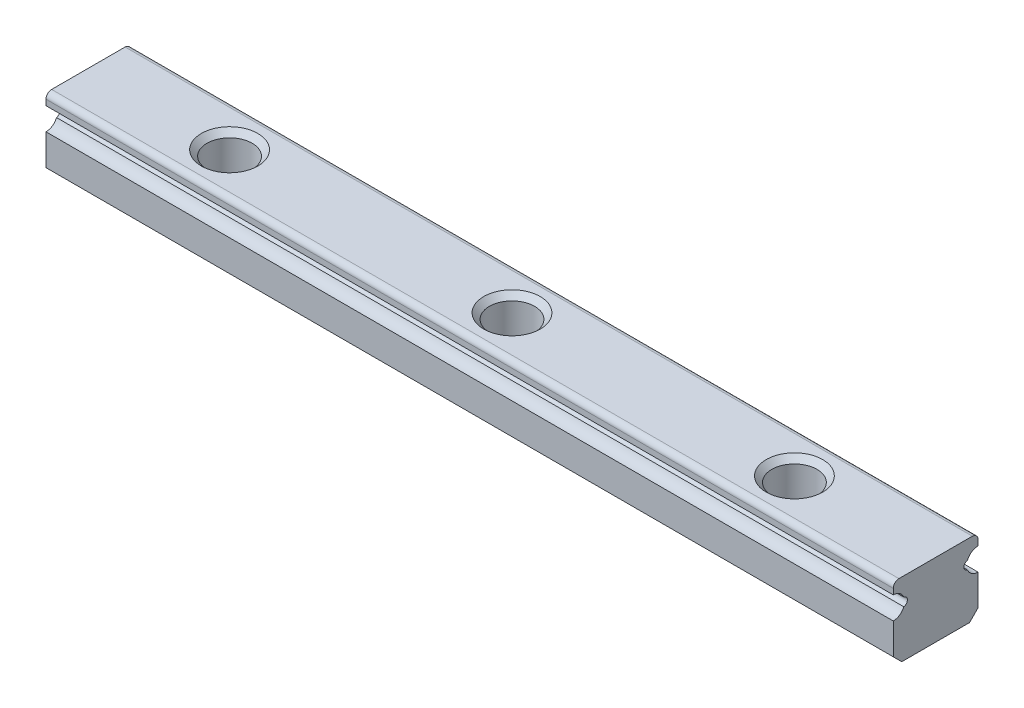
ISO-10303-21;
HEADER;
FILE_DESCRIPTION(('STEP AP214'),'2;1');
FILE_NAME('part.step','',(''),(''),'','','');
FILE_SCHEMA(('AUTOMOTIVE_DESIGN { 1 0 10303 214 1 1 1 1 }'));
ENDSEC;
DATA;
#1=APPLICATION_CONTEXT('core data for automotive mechanical design processes');
#2=APPLICATION_PROTOCOL_DEFINITION('international standard','automotive_design',2000,#1);
#3=PRODUCT_CONTEXT('',#1,'mechanical');
#4=PRODUCT('Part','Part','',(#3));
#5=PRODUCT_RELATED_PRODUCT_CATEGORY('part','',(#4));
#6=PRODUCT_DEFINITION_FORMATION('','',#4);
#7=PRODUCT_DEFINITION_CONTEXT('part definition',#1,'design');
#8=PRODUCT_DEFINITION('design','',#6,#7);
#9=PRODUCT_DEFINITION_SHAPE('','',#8);
#10=(LENGTH_UNIT() NAMED_UNIT(*) SI_UNIT(.MILLI.,.METRE.));
#11=(NAMED_UNIT(*) PLANE_ANGLE_UNIT() SI_UNIT($,.RADIAN.));
#12=(NAMED_UNIT(*) SI_UNIT($,.STERADIAN.) SOLID_ANGLE_UNIT());
#13=UNCERTAINTY_MEASURE_WITH_UNIT(LENGTH_MEASURE(1.E-05),#10,'distance_accuracy_value','');
#14=(GEOMETRIC_REPRESENTATION_CONTEXT(3) GLOBAL_UNCERTAINTY_ASSIGNED_CONTEXT((#13)) GLOBAL_UNIT_ASSIGNED_CONTEXT((#10,
#11,#12)) REPRESENTATION_CONTEXT('',''));
#15=CARTESIAN_POINT('',(0.,0.,0.));
#16=DIRECTION('',(0.,0.,1.));
#17=DIRECTION('',(1.,0.,0.));
#18=AXIS2_PLACEMENT_3D('',#15,#16,#17);
#19=CARTESIAN_POINT('',(-30.,0.3,1.5));
#20=DIRECTION('',(0.,0.,1.));
#21=DIRECTION('',(0.,-1.,0.));
#22=AXIS2_PLACEMENT_3D('',#19,#20,#21);
#23=PLANE('',#22);
#24=DIRECTION('',(1.,0.,0.));
#25=VECTOR('',#24,1.);
#26=CARTESIAN_POINT('',(-30.,1.4,1.5));
#27=LINE('',#26,#25);
#28=CARTESIAN_POINT('',(-30.,1.4,1.5));
#29=VERTEX_POINT('',#28);
#30=CARTESIAN_POINT('',(0.,1.4,1.5));
#31=VERTEX_POINT('',#30);
#32=EDGE_CURVE('E179',#29,#31,#27,.T.);
#33=ORIENTED_EDGE('',*,*,#32,.F.);
#34=DIRECTION('',(0.,-1.,0.));
#35=VECTOR('',#34,1.);
#36=CARTESIAN_POINT('',(-30.,0.3,1.5));
#37=LINE('',#36,#35);
#38=CARTESIAN_POINT('',(-30.,0.3,1.5));
#39=VERTEX_POINT('',#38);
#40=EDGE_CURVE('E167',#29,#39,#37,.T.);
#41=ORIENTED_EDGE('',*,*,#40,.T.);
#42=DIRECTION('',(1.,0.,0.));
#43=VECTOR('',#42,1.);
#44=CARTESIAN_POINT('',(-30.,0.3,1.5));
#45=LINE('',#44,#43);
#46=CARTESIAN_POINT('',(0.,0.3,1.5));
#47=VERTEX_POINT('',#46);
#48=EDGE_CURVE('E244',#39,#47,#45,.T.);
#49=ORIENTED_EDGE('',*,*,#48,.T.);
#50=DIRECTION('',(0.,-1.,0.));
#51=VECTOR('',#50,1.);
#52=CARTESIAN_POINT('',(0.,0.3,1.5));
#53=LINE('',#52,#51);
#54=EDGE_CURVE('E226',#31,#47,#53,.T.);
#55=ORIENTED_EDGE('',*,*,#54,.F.);
#56=EDGE_LOOP('',(#33,#41,#49,#55));
#57=FACE_BOUND('',#56,.T.);
#58=ADVANCED_FACE('F32',(#57),#23,.T.);
#59=CARTESIAN_POINT('',(-30.,0.3,-1.5));
#60=DIRECTION('',(0.,0.,-1.));
#61=DIRECTION('',(0.,1.,0.));
#62=AXIS2_PLACEMENT_3D('',#59,#60,#61);
#63=PLANE('',#62);
#64=DIRECTION('',(0.,1.,0.));
#65=VECTOR('',#64,1.);
#66=CARTESIAN_POINT('',(-30.,0.3,-1.5));
#67=LINE('',#66,#65);
#68=CARTESIAN_POINT('',(-30.,2.2,-1.5));
#69=VERTEX_POINT('',#68);
#70=CARTESIAN_POINT('',(-30.,2.4,-1.5));
#71=VERTEX_POINT('',#70);
#72=EDGE_CURVE('E238',#69,#71,#67,.T.);
#73=ORIENTED_EDGE('',*,*,#72,.T.);
#74=DIRECTION('',(1.,0.,0.));
#75=VECTOR('',#74,1.);
#76=CARTESIAN_POINT('',(-30.,2.4,-1.5));
#77=LINE('',#76,#75);
#78=CARTESIAN_POINT('',(0.,2.4,-1.5));
#79=VERTEX_POINT('',#78);
#80=EDGE_CURVE('E286',#71,#79,#77,.T.);
#81=ORIENTED_EDGE('',*,*,#80,.T.);
#82=DIRECTION('',(0.,1.,0.));
#83=VECTOR('',#82,1.);
#84=CARTESIAN_POINT('',(0.,0.3,-1.5));
#85=LINE('',#84,#83);
#86=CARTESIAN_POINT('',(0.,2.2,-1.5));
#87=VERTEX_POINT('',#86);
#88=EDGE_CURVE('E256',#87,#79,#85,.T.);
#89=ORIENTED_EDGE('',*,*,#88,.F.);
#90=DIRECTION('',(1.,0.,0.));
#91=VECTOR('',#90,1.);
#92=CARTESIAN_POINT('',(-30.,2.2,-1.5));
#93=LINE('',#92,#91);
#94=EDGE_CURVE('E200',#69,#87,#93,.T.);
#95=ORIENTED_EDGE('',*,*,#94,.F.);
#96=EDGE_LOOP('',(#73,#81,#89,#95));
#97=FACE_BOUND('',#96,.T.);
#98=ADVANCED_FACE('F307',(#97),#63,.T.);
#99=CARTESIAN_POINT('',(-30.,0.,-1.2));
#100=DIRECTION('',(0.,-1.,0.));
#101=DIRECTION('',(0.,0.,-1.));
#102=AXIS2_PLACEMENT_3D('',#99,#100,#101);
#103=PLANE('',#102);
#104=CARTESIAN_POINT('',(-15.,0.,0.));
#105=DIRECTION('',(0.,1.,0.));
#106=DIRECTION('',(0.,0.,1.));
#107=AXIS2_PLACEMENT_3D('',#104,#105,#106);
#108=CIRCLE('',#107,1.);
#109=CARTESIAN_POINT('',(-15.,0.,0.999999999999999));
#110=VERTEX_POINT('',#109);
#111=EDGE_CURVE('E202',#110,#110,#108,.T.);
#112=ORIENTED_EDGE('',*,*,#111,.T.);
#113=EDGE_LOOP('',(#112));
#114=FACE_BOUND('',#113,.T.);
#115=DIRECTION('',(0.,0.,-1.));
#116=VECTOR('',#115,1.);
#117=CARTESIAN_POINT('',(0.,0.,-1.2));
#118=LINE('',#117,#116);
#119=CARTESIAN_POINT('',(0.,0.,1.2));
#120=VERTEX_POINT('',#119);
#121=CARTESIAN_POINT('',(0.,0.,-1.2));
#122=VERTEX_POINT('',#121);
#123=EDGE_CURVE('E250',#120,#122,#118,.T.);
#124=ORIENTED_EDGE('',*,*,#123,.F.);
#125=DIRECTION('',(1.,0.,0.));
#126=VECTOR('',#125,1.);
#127=CARTESIAN_POINT('',(-30.,0.,1.2));
#128=LINE('',#127,#126);
#129=CARTESIAN_POINT('',(-30.,0.,1.2));
#130=VERTEX_POINT('',#129);
#131=EDGE_CURVE('E268',#130,#120,#128,.T.);
#132=ORIENTED_EDGE('',*,*,#131,.F.);
#133=DIRECTION('',(0.,0.,-1.));
#134=VECTOR('',#133,1.);
#135=CARTESIAN_POINT('',(-30.,0.,-1.2));
#136=LINE('',#135,#134);
#137=CARTESIAN_POINT('',(-30.,0.,-1.2));
#138=VERTEX_POINT('',#137);
#139=EDGE_CURVE('E232',#130,#138,#136,.T.);
#140=ORIENTED_EDGE('',*,*,#139,.T.);
#141=DIRECTION('',(1.,0.,0.));
#142=VECTOR('',#141,1.);
#143=CARTESIAN_POINT('',(-30.,0.,-1.2));
#144=LINE('',#143,#142);
#145=EDGE_CURVE('E266',#138,#122,#144,.T.);
#146=ORIENTED_EDGE('',*,*,#145,.T.);
#147=EDGE_LOOP('',(#124,#132,#140,#146));
#148=FACE_BOUND('',#147,.T.);
#149=CARTESIAN_POINT('',(-5.,0.,0.));
#150=DIRECTION('',(0.,1.,0.));
#151=DIRECTION('',(0.,0.,1.));
#152=AXIS2_PLACEMENT_3D('',#149,#150,#151);
#153=CIRCLE('',#152,1.);
#154=CARTESIAN_POINT('',(-5.,0.,0.999999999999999));
#155=VERTEX_POINT('',#154);
#156=EDGE_CURVE('E214',#155,#155,#153,.T.);
#157=ORIENTED_EDGE('',*,*,#156,.T.);
#158=EDGE_LOOP('',(#157));
#159=FACE_BOUND('',#158,.T.);
#160=CARTESIAN_POINT('',(-25.,0.,0.));
#161=DIRECTION('',(0.,1.,0.));
#162=DIRECTION('',(0.,0.,1.));
#163=AXIS2_PLACEMENT_3D('',#160,#161,#162);
#164=CIRCLE('',#163,1.);
#165=CARTESIAN_POINT('',(-25.,0.,0.999999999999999));
#166=VERTEX_POINT('',#165);
#167=EDGE_CURVE('E265',#166,#166,#164,.T.);
#168=ORIENTED_EDGE('',*,*,#167,.T.);
#169=EDGE_LOOP('',(#168));
#170=FACE_BOUND('',#169,.T.);
#171=ADVANCED_FACE('F334',(#114,#148,#159,#170),#103,.T.);
#172=CARTESIAN_POINT('',(0.,2.4,1.5));
#173=VERTEX_POINT('',#172);
#174=CARTESIAN_POINT('',(0.,2.2,1.5));
#175=VERTEX_POINT('',#174);
#176=EDGE_CURVE('E245',#173,#175,#53,.T.);
#177=ORIENTED_EDGE('',*,*,#176,.F.);
#178=DIRECTION('',(1.,0.,0.));
#179=VECTOR('',#178,1.);
#180=CARTESIAN_POINT('',(-30.,2.4,1.5));
#181=LINE('',#180,#179);
#182=CARTESIAN_POINT('',(-30.,2.4,1.5));
#183=VERTEX_POINT('',#182);
#184=EDGE_CURVE('E11',#173,#183,#181,.F.);
#185=ORIENTED_EDGE('',*,*,#184,.T.);
#186=CARTESIAN_POINT('',(-30.,2.2,1.5));
#187=VERTEX_POINT('',#186);
#188=EDGE_CURVE('E227',#183,#187,#37,.T.);
#189=ORIENTED_EDGE('',*,*,#188,.T.);
#190=DIRECTION('',(1.,0.,0.));
#191=VECTOR('',#190,1.);
#192=CARTESIAN_POINT('',(-30.,2.2,1.5));
#193=LINE('',#192,#191);
#194=EDGE_CURVE('E175',#175,#187,#193,.F.);
#195=ORIENTED_EDGE('',*,*,#194,.F.);
#196=EDGE_LOOP('',(#177,#185,#189,#195));
#197=FACE_BOUND('',#196,.T.);
#198=ADVANCED_FACE('F322',(#197),#23,.T.);
#199=CARTESIAN_POINT('',(-30.,2.6,-1.5));
#200=DIRECTION('',(0.,1.,0.));
#201=DIRECTION('',(0.,0.,1.));
#202=AXIS2_PLACEMENT_3D('',#199,#200,#201);
#203=PLANE('',#202);
#204=CARTESIAN_POINT('',(-15.,2.6,0.));
#205=DIRECTION('',(0.,1.,0.));
#206=DIRECTION('',(0.,0.,1.));
#207=AXIS2_PLACEMENT_3D('',#204,#205,#206);
#208=CIRCLE('',#207,1.);
#209=CARTESIAN_POINT('',(-15.,2.6,1.));
#210=VERTEX_POINT('',#209);
#211=EDGE_CURVE('E205',#210,#210,#208,.T.);
#212=ORIENTED_EDGE('',*,*,#211,.F.);
#213=EDGE_LOOP('',(#212));
#214=FACE_BOUND('',#213,.T.);
#215=CARTESIAN_POINT('',(-5.,2.6,0.));
#216=DIRECTION('',(0.,1.,0.));
#217=DIRECTION('',(0.,0.,1.));
#218=AXIS2_PLACEMENT_3D('',#215,#216,#217);
#219=CIRCLE('',#218,1.);
#220=CARTESIAN_POINT('',(-5.,2.6,1.));
#221=VERTEX_POINT('',#220);
#222=EDGE_CURVE('E223',#221,#221,#219,.T.);
#223=ORIENTED_EDGE('',*,*,#222,.F.);
#224=EDGE_LOOP('',(#223));
#225=FACE_BOUND('',#224,.T.);
#226=DIRECTION('',(0.,0.,1.));
#227=VECTOR('',#226,1.);
#228=CARTESIAN_POINT('',(0.,2.6,-1.5));
#229=LINE('',#228,#227);
#230=CARTESIAN_POINT('',(0.,2.6,-1.3));
#231=VERTEX_POINT('',#230);
#232=CARTESIAN_POINT('',(0.,2.6,1.3));
#233=VERTEX_POINT('',#232);
#234=EDGE_CURVE('E260',#231,#233,#229,.T.);
#235=ORIENTED_EDGE('',*,*,#234,.F.);
#236=DIRECTION('',(1.,0.,0.));
#237=VECTOR('',#236,1.);
#238=CARTESIAN_POINT('',(-30.,2.6,-1.3));
#239=LINE('',#238,#237);
#240=CARTESIAN_POINT('',(-30.,2.6,-1.3));
#241=VERTEX_POINT('',#240);
#242=EDGE_CURVE('E296',#231,#241,#239,.F.);
#243=ORIENTED_EDGE('',*,*,#242,.T.);
#244=DIRECTION('',(0.,0.,1.));
#245=VECTOR('',#244,1.);
#246=CARTESIAN_POINT('',(-30.,2.6,-1.5));
#247=LINE('',#246,#245);
#248=CARTESIAN_POINT('',(-30.,2.6,1.3));
#249=VERTEX_POINT('',#248);
#250=EDGE_CURVE('E242',#241,#249,#247,.T.);
#251=ORIENTED_EDGE('',*,*,#250,.T.);
#252=DIRECTION('',(1.,0.,0.));
#253=VECTOR('',#252,1.);
#254=CARTESIAN_POINT('',(-30.,2.6,1.3));
#255=LINE('',#254,#253);
#256=EDGE_CURVE('E293',#249,#233,#255,.T.);
#257=ORIENTED_EDGE('',*,*,#256,.T.);
#258=EDGE_LOOP('',(#235,#243,#251,#257));
#259=FACE_BOUND('',#258,.T.);
#260=CARTESIAN_POINT('',(-25.,2.6,0.));
#261=DIRECTION('',(0.,1.,0.));
#262=DIRECTION('',(0.,0.,1.));
#263=AXIS2_PLACEMENT_3D('',#260,#261,#262);
#264=CIRCLE('',#263,1.);
#265=CARTESIAN_POINT('',(-25.,2.6,1.));
#266=VERTEX_POINT('',#265);
#267=EDGE_CURVE('E274',#266,#266,#264,.T.);
#268=ORIENTED_EDGE('',*,*,#267,.F.);
#269=EDGE_LOOP('',(#268));
#270=FACE_BOUND('',#269,.T.);
#271=ADVANCED_FACE('F316',(#214,#225,#259,#270),#203,.T.);
#272=DIRECTION('',(1.,0.,0.));
#273=VECTOR('',#272,1.);
#274=CARTESIAN_POINT('',(-30.,1.4,-1.5));
#275=LINE('',#274,#273);
#276=CARTESIAN_POINT('',(0.,1.4,-1.5));
#277=VERTEX_POINT('',#276);
#278=CARTESIAN_POINT('',(-30.,1.4,-1.5));
#279=VERTEX_POINT('',#278);
#280=EDGE_CURVE('E197',#277,#279,#275,.F.);
#281=ORIENTED_EDGE('',*,*,#280,.F.);
#282=CARTESIAN_POINT('',(0.,0.3,-1.5));
#283=VERTEX_POINT('',#282);
#284=EDGE_CURVE('E257',#283,#277,#85,.T.);
#285=ORIENTED_EDGE('',*,*,#284,.F.);
#286=DIRECTION('',(1.,0.,0.));
#287=VECTOR('',#286,1.);
#288=CARTESIAN_POINT('',(-30.,0.3,-1.5));
#289=LINE('',#288,#287);
#290=CARTESIAN_POINT('',(-30.,0.3,-1.5));
#291=VERTEX_POINT('',#290);
#292=EDGE_CURVE('E263',#291,#283,#289,.T.);
#293=ORIENTED_EDGE('',*,*,#292,.F.);
#294=EDGE_CURVE('E239',#291,#279,#67,.T.);
#295=ORIENTED_EDGE('',*,*,#294,.T.);
#296=EDGE_LOOP('',(#281,#285,#293,#295));
#297=FACE_BOUND('',#296,.T.);
#298=ADVANCED_FACE('F344',(#297),#63,.T.);
#299=CARTESIAN_POINT('',(-30.,0.,-1.2));
#300=DIRECTION('',(0.,-0.707106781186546,-0.707106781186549));
#301=DIRECTION('',(0.,0.707106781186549,-0.707106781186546));
#302=AXIS2_PLACEMENT_3D('',#299,#300,#301);
#303=PLANE('',#302);
#304=DIRECTION('',(0.,0.707106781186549,-0.707106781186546));
#305=VECTOR('',#304,1.);
#306=CARTESIAN_POINT('',(0.,0.,-1.2));
#307=LINE('',#306,#305);
#308=EDGE_CURVE('E253',#122,#283,#307,.T.);
#309=ORIENTED_EDGE('',*,*,#308,.F.);
#310=ORIENTED_EDGE('',*,*,#145,.F.);
#311=DIRECTION('',(0.,0.707106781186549,-0.707106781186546));
#312=VECTOR('',#311,1.);
#313=CARTESIAN_POINT('',(-30.,0.,-1.2));
#314=LINE('',#313,#312);
#315=EDGE_CURVE('E235',#138,#291,#314,.T.);
#316=ORIENTED_EDGE('',*,*,#315,.T.);
#317=ORIENTED_EDGE('',*,*,#292,.T.);
#318=EDGE_LOOP('',(#309,#310,#316,#317));
#319=FACE_BOUND('',#318,.T.);
#320=ADVANCED_FACE('F339',(#319),#303,.T.);
#321=CARTESIAN_POINT('',(-30.,0.,1.2));
#322=DIRECTION('',(0.,-0.707106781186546,0.707106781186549));
#323=DIRECTION('',(0.,-0.707106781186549,-0.707106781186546));
#324=AXIS2_PLACEMENT_3D('',#321,#322,#323);
#325=PLANE('',#324);
#326=DIRECTION('',(0.,-0.707106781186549,-0.707106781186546));
#327=VECTOR('',#326,1.);
#328=CARTESIAN_POINT('',(0.,0.,1.2));
#329=LINE('',#328,#327);
#330=EDGE_CURVE('E247',#47,#120,#329,.T.);
#331=ORIENTED_EDGE('',*,*,#330,.F.);
#332=ORIENTED_EDGE('',*,*,#48,.F.);
#333=DIRECTION('',(0.,-0.707106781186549,-0.707106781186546));
#334=VECTOR('',#333,1.);
#335=CARTESIAN_POINT('',(-30.,0.,1.2));
#336=LINE('',#335,#334);
#337=EDGE_CURVE('E229',#39,#130,#336,.T.);
#338=ORIENTED_EDGE('',*,*,#337,.T.);
#339=ORIENTED_EDGE('',*,*,#131,.T.);
#340=EDGE_LOOP('',(#331,#332,#338,#339));
#341=FACE_BOUND('',#340,.T.);
#342=ADVANCED_FACE('F330',(#341),#325,.T.);
#343=CARTESIAN_POINT('',(-30.,0.,1.5));
#344=DIRECTION('',(1.,0.,0.));
#345=DIRECTION('',(0.,0.,-1.));
#346=AXIS2_PLACEMENT_3D('',#343,#344,#345);
#347=PLANE('',#346);
#348=ORIENTED_EDGE('',*,*,#250,.F.);
#349=CARTESIAN_POINT('',(-30.,2.4,-1.3));
#350=DIRECTION('',(1.,0.,0.));
#351=DIRECTION('',(0.,0.,-1.));
#352=AXIS2_PLACEMENT_3D('',#349,#350,#351);
#353=CIRCLE('',#352,0.2);
#354=EDGE_CURVE('E40',#241,#71,#353,.F.);
#355=ORIENTED_EDGE('',*,*,#354,.T.);
#356=ORIENTED_EDGE('',*,*,#72,.F.);
#357=CARTESIAN_POINT('',(-30.,1.8,-1.5));
#358=DIRECTION('',(1.,0.,0.));
#359=DIRECTION('',(0.,0.,-1.));
#360=AXIS2_PLACEMENT_3D('',#357,#358,#359);
#361=CIRCLE('',#360,0.4);
#362=CARTESIAN_POINT('',(-30.,1.94846149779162,-1.12857142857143));
#363=VERTEX_POINT('',#362);
#364=EDGE_CURVE('E185',#69,#363,#361,.T.);
#365=ORIENTED_EDGE('',*,*,#364,.T.);
#366=CARTESIAN_POINT('',(-30.,1.8,-1.15));
#367=DIRECTION('',(1.,0.,0.));
#368=DIRECTION('',(0.,0.,-1.));
#369=AXIS2_PLACEMENT_3D('',#366,#367,#368);
#370=CIRCLE('',#369,0.150000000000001);
#371=CARTESIAN_POINT('',(-30.,1.65153850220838,-1.12857142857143));
#372=VERTEX_POINT('',#371);
#373=EDGE_CURVE('E182',#363,#372,#370,.T.);
#374=ORIENTED_EDGE('',*,*,#373,.T.);
#375=EDGE_CURVE('E187',#372,#279,#361,.T.);
#376=ORIENTED_EDGE('',*,*,#375,.T.);
#377=ORIENTED_EDGE('',*,*,#294,.F.);
#378=ORIENTED_EDGE('',*,*,#315,.F.);
#379=ORIENTED_EDGE('',*,*,#139,.F.);
#380=ORIENTED_EDGE('',*,*,#337,.F.);
#381=ORIENTED_EDGE('',*,*,#40,.F.);
#382=CARTESIAN_POINT('',(-30.,1.8,1.5));
#383=DIRECTION('',(1.,0.,0.));
#384=DIRECTION('',(0.,0.,1.));
#385=AXIS2_PLACEMENT_3D('',#382,#383,#384);
#386=CIRCLE('',#385,0.4);
#387=CARTESIAN_POINT('',(-30.,1.65153850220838,1.12857142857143));
#388=VERTEX_POINT('',#387);
#389=EDGE_CURVE('E148',#29,#388,#386,.T.);
#390=ORIENTED_EDGE('',*,*,#389,.T.);
#391=CARTESIAN_POINT('',(-30.,1.8,1.15));
#392=DIRECTION('',(1.,0.,0.));
#393=DIRECTION('',(0.,0.,1.));
#394=AXIS2_PLACEMENT_3D('',#391,#392,#393);
#395=CIRCLE('',#394,0.150000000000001);
#396=CARTESIAN_POINT('',(-30.,1.94846149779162,1.12857142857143));
#397=VERTEX_POINT('',#396);
#398=EDGE_CURVE('E156',#388,#397,#395,.T.);
#399=ORIENTED_EDGE('',*,*,#398,.T.);
#400=EDGE_CURVE('E162',#397,#187,#386,.T.);
#401=ORIENTED_EDGE('',*,*,#400,.T.);
#402=ORIENTED_EDGE('',*,*,#188,.F.);
#403=CARTESIAN_POINT('',(-30.,2.4,1.3));
#404=DIRECTION('',(1.,0.,0.));
#405=DIRECTION('',(0.,0.,-1.));
#406=AXIS2_PLACEMENT_3D('',#403,#404,#405);
#407=CIRCLE('',#406,0.2);
#408=EDGE_CURVE('E52',#183,#249,#407,.F.);
#409=ORIENTED_EDGE('',*,*,#408,.T.);
#410=EDGE_LOOP('',(#348,#355,#356,#365,#374,#376,#377,#378,#379,#380,#381,#390,#399,#401,#402,#409));
#411=FACE_BOUND('',#410,.T.);
#412=ADVANCED_FACE('F165',(#411),#347,.F.);
#413=CARTESIAN_POINT('',(0.,0.,1.5));
#414=DIRECTION('',(1.,0.,0.));
#415=DIRECTION('',(0.,0.,-1.));
#416=AXIS2_PLACEMENT_3D('',#413,#414,#415);
#417=PLANE('',#416);
#418=ORIENTED_EDGE('',*,*,#88,.T.);
#419=CARTESIAN_POINT('',(0.,2.4,-1.3));
#420=DIRECTION('',(1.,0.,0.));
#421=DIRECTION('',(0.,0.,-1.));
#422=AXIS2_PLACEMENT_3D('',#419,#420,#421);
#423=CIRCLE('',#422,0.2);
#424=EDGE_CURVE('E291',#79,#231,#423,.T.);
#425=ORIENTED_EDGE('',*,*,#424,.T.);
#426=ORIENTED_EDGE('',*,*,#234,.T.);
#427=CARTESIAN_POINT('',(0.,2.4,1.3));
#428=DIRECTION('',(1.,0.,0.));
#429=DIRECTION('',(0.,0.,-1.));
#430=AXIS2_PLACEMENT_3D('',#427,#428,#429);
#431=CIRCLE('',#430,0.2);
#432=EDGE_CURVE('E289',#233,#173,#431,.T.);
#433=ORIENTED_EDGE('',*,*,#432,.T.);
#434=ORIENTED_EDGE('',*,*,#176,.T.);
#435=CARTESIAN_POINT('',(0.,1.8,1.5));
#436=DIRECTION('',(1.,0.,0.));
#437=DIRECTION('',(0.,0.,1.));
#438=AXIS2_PLACEMENT_3D('',#435,#436,#437);
#439=CIRCLE('',#438,0.4);
#440=CARTESIAN_POINT('',(0.,1.94846149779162,1.12857142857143));
#441=VERTEX_POINT('',#440);
#442=EDGE_CURVE('E170',#441,#175,#439,.T.);
#443=ORIENTED_EDGE('',*,*,#442,.F.);
#444=CARTESIAN_POINT('',(0.,1.8,1.15));
#445=DIRECTION('',(1.,0.,0.));
#446=DIRECTION('',(0.,0.,1.));
#447=AXIS2_PLACEMENT_3D('',#444,#445,#446);
#448=CIRCLE('',#447,0.150000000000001);
#449=CARTESIAN_POINT('',(0.,1.65153850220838,1.12857142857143));
#450=VERTEX_POINT('',#449);
#451=EDGE_CURVE('E168',#450,#441,#448,.T.);
#452=ORIENTED_EDGE('',*,*,#451,.F.);
#453=CARTESIAN_POINT('',(0.,1.8,1.5));
#454=DIRECTION('',(1.,0.,0.));
#455=DIRECTION('',(0.,0.,-1.));
#456=AXIS2_PLACEMENT_3D('',#453,#454,#455);
#457=CIRCLE('',#456,0.4);
#458=EDGE_CURVE('E151',#31,#450,#457,.T.);
#459=ORIENTED_EDGE('',*,*,#458,.F.);
#460=ORIENTED_EDGE('',*,*,#54,.T.);
#461=ORIENTED_EDGE('',*,*,#330,.T.);
#462=ORIENTED_EDGE('',*,*,#123,.T.);
#463=ORIENTED_EDGE('',*,*,#308,.T.);
#464=ORIENTED_EDGE('',*,*,#284,.T.);
#465=CARTESIAN_POINT('',(0.,1.8,-1.5));
#466=DIRECTION('',(1.,0.,0.));
#467=DIRECTION('',(0.,0.,-1.));
#468=AXIS2_PLACEMENT_3D('',#465,#466,#467);
#469=CIRCLE('',#468,0.4);
#470=CARTESIAN_POINT('',(0.,1.65153850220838,-1.12857142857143));
#471=VERTEX_POINT('',#470);
#472=EDGE_CURVE('E186',#471,#277,#469,.T.);
#473=ORIENTED_EDGE('',*,*,#472,.F.);
#474=CARTESIAN_POINT('',(0.,1.8,-1.15));
#475=DIRECTION('',(1.,0.,0.));
#476=DIRECTION('',(0.,0.,-1.));
#477=AXIS2_PLACEMENT_3D('',#474,#475,#476);
#478=CIRCLE('',#477,0.150000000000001);
#479=CARTESIAN_POINT('',(0.,1.94846149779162,-1.12857142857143));
#480=VERTEX_POINT('',#479);
#481=EDGE_CURVE('E181',#480,#471,#478,.T.);
#482=ORIENTED_EDGE('',*,*,#481,.F.);
#483=CARTESIAN_POINT('',(0.,1.8,-1.5));
#484=DIRECTION('',(1.,0.,0.));
#485=DIRECTION('',(0.,0.,-1.));
#486=AXIS2_PLACEMENT_3D('',#483,#484,#485);
#487=CIRCLE('',#486,0.4);
#488=EDGE_CURVE('E283',#87,#480,#487,.T.);
#489=ORIENTED_EDGE('',*,*,#488,.F.);
#490=EDGE_LOOP('',(#418,#425,#426,#433,#434,#443,#452,#459,#460,#461,#462,#463,#464,#473,#482,#489));
#491=FACE_BOUND('',#490,.T.);
#492=ADVANCED_FACE('F313',(#491),#417,.T.);
#493=CARTESIAN_POINT('',(-5.,2.6,0.));
#494=DIRECTION('',(0.,1.,0.));
#495=DIRECTION('',(0.,0.,1.));
#496=AXIS2_PLACEMENT_3D('',#493,#494,#495);
#497=CONICAL_SURFACE('',#496,1.,0.785398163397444);
#498=CARTESIAN_POINT('',(-5.,2.4,0.));
#499=DIRECTION('',(0.,1.,0.));
#500=DIRECTION('',(0.,0.,1.));
#501=AXIS2_PLACEMENT_3D('',#498,#499,#500);
#502=CIRCLE('',#501,0.8);
#503=CARTESIAN_POINT('',(-5.,2.4,0.8));
#504=VERTEX_POINT('',#503);
#505=EDGE_CURVE('E220',#504,#504,#502,.T.);
#506=ORIENTED_EDGE('',*,*,#505,.F.);
#507=EDGE_LOOP('',(#506));
#508=FACE_BOUND('',#507,.T.);
#509=ORIENTED_EDGE('',*,*,#222,.T.);
#510=EDGE_LOOP('',(#509));
#511=FACE_BOUND('',#510,.T.);
#512=ADVANCED_FACE('F400',(#508,#511),#497,.F.);
#513=CARTESIAN_POINT('',(-5.,2.6,0.));
#514=DIRECTION('',(0.,1.,0.));
#515=DIRECTION('',(0.,0.,1.));
#516=AXIS2_PLACEMENT_3D('',#513,#514,#515);
#517=CYLINDRICAL_SURFACE('',#516,0.8);
#518=CARTESIAN_POINT('',(-5.,0.2,0.));
#519=DIRECTION('',(0.,1.,0.));
#520=DIRECTION('',(0.,0.,1.));
#521=AXIS2_PLACEMENT_3D('',#518,#519,#520);
#522=CIRCLE('',#521,0.8);
#523=CARTESIAN_POINT('',(-5.,0.2,0.8));
#524=VERTEX_POINT('',#523);
#525=EDGE_CURVE('E217',#524,#524,#522,.T.);
#526=ORIENTED_EDGE('',*,*,#525,.F.);
#527=EDGE_LOOP('',(#526));
#528=FACE_BOUND('',#527,.T.);
#529=ORIENTED_EDGE('',*,*,#505,.T.);
#530=EDGE_LOOP('',(#529));
#531=FACE_BOUND('',#530,.T.);
#532=ADVANCED_FACE('F404',(#528,#531),#517,.F.);
#533=CARTESIAN_POINT('',(-5.,0.2,0.));
#534=DIRECTION('',(0.,-1.,0.));
#535=DIRECTION('',(0.,0.,-1.));
#536=AXIS2_PLACEMENT_3D('',#533,#534,#535);
#537=CONICAL_SURFACE('',#536,0.8,0.785398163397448);
#538=ORIENTED_EDGE('',*,*,#156,.F.);
#539=EDGE_LOOP('',(#538));
#540=FACE_BOUND('',#539,.T.);
#541=ORIENTED_EDGE('',*,*,#525,.T.);
#542=EDGE_LOOP('',(#541));
#543=FACE_BOUND('',#542,.T.);
#544=ADVANCED_FACE('F408',(#540,#543),#537,.F.);
#545=CARTESIAN_POINT('',(-15.,2.6,0.));
#546=DIRECTION('',(0.,1.,0.));
#547=DIRECTION('',(0.,0.,1.));
#548=AXIS2_PLACEMENT_3D('',#545,#546,#547);
#549=CONICAL_SURFACE('',#548,1.,0.785398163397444);
#550=CARTESIAN_POINT('',(-15.,2.4,0.));
#551=DIRECTION('',(0.,1.,0.));
#552=DIRECTION('',(0.,0.,1.));
#553=AXIS2_PLACEMENT_3D('',#550,#551,#552);
#554=CIRCLE('',#553,0.8);
#555=CARTESIAN_POINT('',(-15.,2.4,0.8));
#556=VERTEX_POINT('',#555);
#557=EDGE_CURVE('E211',#556,#556,#554,.T.);
#558=ORIENTED_EDGE('',*,*,#557,.F.);
#559=EDGE_LOOP('',(#558));
#560=FACE_BOUND('',#559,.T.);
#561=ORIENTED_EDGE('',*,*,#211,.T.);
#562=EDGE_LOOP('',(#561));
#563=FACE_BOUND('',#562,.T.);
#564=ADVANCED_FACE('F412',(#560,#563),#549,.F.);
#565=CARTESIAN_POINT('',(-15.,2.6,0.));
#566=DIRECTION('',(0.,1.,0.));
#567=DIRECTION('',(0.,0.,1.));
#568=AXIS2_PLACEMENT_3D('',#565,#566,#567);
#569=CYLINDRICAL_SURFACE('',#568,0.8);
#570=CARTESIAN_POINT('',(-15.,0.2,0.));
#571=DIRECTION('',(0.,1.,0.));
#572=DIRECTION('',(0.,0.,1.));
#573=AXIS2_PLACEMENT_3D('',#570,#571,#572);
#574=CIRCLE('',#573,0.8);
#575=CARTESIAN_POINT('',(-15.,0.2,0.8));
#576=VERTEX_POINT('',#575);
#577=EDGE_CURVE('E208',#576,#576,#574,.T.);
#578=ORIENTED_EDGE('',*,*,#577,.F.);
#579=EDGE_LOOP('',(#578));
#580=FACE_BOUND('',#579,.T.);
#581=ORIENTED_EDGE('',*,*,#557,.T.);
#582=EDGE_LOOP('',(#581));
#583=FACE_BOUND('',#582,.T.);
#584=ADVANCED_FACE('F417',(#580,#583),#569,.F.);
#585=CARTESIAN_POINT('',(-15.,0.2,0.));
#586=DIRECTION('',(0.,-1.,0.));
#587=DIRECTION('',(0.,0.,-1.));
#588=AXIS2_PLACEMENT_3D('',#585,#586,#587);
#589=CONICAL_SURFACE('',#588,0.8,0.785398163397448);
#590=ORIENTED_EDGE('',*,*,#111,.F.);
#591=EDGE_LOOP('',(#590));
#592=FACE_BOUND('',#591,.T.);
#593=ORIENTED_EDGE('',*,*,#577,.T.);
#594=EDGE_LOOP('',(#593));
#595=FACE_BOUND('',#594,.T.);
#596=ADVANCED_FACE('F414',(#592,#595),#589,.F.);
#597=CARTESIAN_POINT('',(-25.,0.2,0.));
#598=DIRECTION('',(0.,-1.,0.));
#599=DIRECTION('',(0.,0.,-1.));
#600=AXIS2_PLACEMENT_3D('',#597,#598,#599);
#601=CONICAL_SURFACE('',#600,0.8,0.785398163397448);
#602=ORIENTED_EDGE('',*,*,#167,.F.);
#603=EDGE_LOOP('',(#602));
#604=FACE_BOUND('',#603,.T.);
#605=CARTESIAN_POINT('',(-25.,0.2,0.));
#606=DIRECTION('',(0.,1.,0.));
#607=DIRECTION('',(0.,0.,1.));
#608=AXIS2_PLACEMENT_3D('',#605,#606,#607);
#609=CIRCLE('',#608,0.8);
#610=CARTESIAN_POINT('',(-25.,0.2,0.8));
#611=VERTEX_POINT('',#610);
#612=EDGE_CURVE('E280',#611,#611,#609,.T.);
#613=ORIENTED_EDGE('',*,*,#612,.T.);
#614=EDGE_LOOP('',(#613));
#615=FACE_BOUND('',#614,.T.);
#616=ADVANCED_FACE('F419',(#604,#615),#601,.F.);
#617=CARTESIAN_POINT('',(-25.,2.6,0.));
#618=DIRECTION('',(0.,1.,0.));
#619=DIRECTION('',(0.,0.,1.));
#620=AXIS2_PLACEMENT_3D('',#617,#618,#619);
#621=CYLINDRICAL_SURFACE('',#620,0.8);
#622=ORIENTED_EDGE('',*,*,#612,.F.);
#623=EDGE_LOOP('',(#622));
#624=FACE_BOUND('',#623,.T.);
#625=CARTESIAN_POINT('',(-25.,2.4,0.));
#626=DIRECTION('',(0.,1.,0.));
#627=DIRECTION('',(0.,0.,1.));
#628=AXIS2_PLACEMENT_3D('',#625,#626,#627);
#629=CIRCLE('',#628,0.8);
#630=CARTESIAN_POINT('',(-25.,2.4,0.8));
#631=VERTEX_POINT('',#630);
#632=EDGE_CURVE('E277',#631,#631,#629,.T.);
#633=ORIENTED_EDGE('',*,*,#632,.T.);
#634=EDGE_LOOP('',(#633));
#635=FACE_BOUND('',#634,.T.);
#636=ADVANCED_FACE('F363',(#624,#635),#621,.F.);
#637=CARTESIAN_POINT('',(-25.,2.6,0.));
#638=DIRECTION('',(0.,1.,0.));
#639=DIRECTION('',(0.,0.,1.));
#640=AXIS2_PLACEMENT_3D('',#637,#638,#639);
#641=CONICAL_SURFACE('',#640,1.,0.785398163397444);
#642=ORIENTED_EDGE('',*,*,#632,.F.);
#643=EDGE_LOOP('',(#642));
#644=FACE_BOUND('',#643,.T.);
#645=ORIENTED_EDGE('',*,*,#267,.T.);
#646=EDGE_LOOP('',(#645));
#647=FACE_BOUND('',#646,.T.);
#648=ADVANCED_FACE('F356',(#644,#647),#641,.F.);
#649=CARTESIAN_POINT('',(-30.,1.8,-1.5));
#650=DIRECTION('',(1.,0.,0.));
#651=DIRECTION('',(0.,0.,-1.));
#652=AXIS2_PLACEMENT_3D('',#649,#650,#651);
#653=CYLINDRICAL_SURFACE('',#652,0.4);
#654=ORIENTED_EDGE('',*,*,#94,.T.);
#655=ORIENTED_EDGE('',*,*,#488,.T.);
#656=DIRECTION('',(1.,0.,0.));
#657=VECTOR('',#656,1.);
#658=CARTESIAN_POINT('',(-30.,1.94846149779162,-1.12857142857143));
#659=LINE('',#658,#657);
#660=EDGE_CURVE('E194',#363,#480,#659,.T.);
#661=ORIENTED_EDGE('',*,*,#660,.F.);
#662=ORIENTED_EDGE('',*,*,#364,.F.);
#663=EDGE_LOOP('',(#654,#655,#661,#662));
#664=FACE_BOUND('',#663,.T.);
#665=ADVANCED_FACE('F354',(#664),#653,.F.);
#666=CARTESIAN_POINT('',(-30.,1.8,-1.15));
#667=DIRECTION('',(1.,0.,0.));
#668=DIRECTION('',(0.,0.,-1.));
#669=AXIS2_PLACEMENT_3D('',#666,#667,#668);
#670=CYLINDRICAL_SURFACE('',#669,0.150000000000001);
#671=ORIENTED_EDGE('',*,*,#481,.T.);
#672=DIRECTION('',(1.,0.,0.));
#673=VECTOR('',#672,1.);
#674=CARTESIAN_POINT('',(-30.,1.65153850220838,-1.12857142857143));
#675=LINE('',#674,#673);
#676=EDGE_CURVE('E190',#372,#471,#675,.T.);
#677=ORIENTED_EDGE('',*,*,#676,.F.);
#678=ORIENTED_EDGE('',*,*,#373,.F.);
#679=ORIENTED_EDGE('',*,*,#660,.T.);
#680=EDGE_LOOP('',(#671,#677,#678,#679));
#681=FACE_BOUND('',#680,.T.);
#682=ADVANCED_FACE('F352',(#681),#670,.F.);
#683=ORIENTED_EDGE('',*,*,#280,.T.);
#684=ORIENTED_EDGE('',*,*,#375,.F.);
#685=ORIENTED_EDGE('',*,*,#676,.T.);
#686=ORIENTED_EDGE('',*,*,#472,.T.);
#687=EDGE_LOOP('',(#683,#684,#685,#686));
#688=FACE_BOUND('',#687,.T.);
#689=ADVANCED_FACE('F348',(#688),#653,.F.);
#690=CARTESIAN_POINT('',(-30.,1.8,1.5));
#691=DIRECTION('',(1.,0.,0.));
#692=DIRECTION('',(0.,0.,-1.));
#693=AXIS2_PLACEMENT_3D('',#690,#691,#692);
#694=CYLINDRICAL_SURFACE('',#693,0.4);
#695=ORIENTED_EDGE('',*,*,#32,.T.);
#696=ORIENTED_EDGE('',*,*,#458,.T.);
#697=DIRECTION('',(1.,0.,0.));
#698=VECTOR('',#697,1.);
#699=CARTESIAN_POINT('',(-30.,1.65153850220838,1.12857142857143));
#700=LINE('',#699,#698);
#701=EDGE_CURVE('E144',#388,#450,#700,.T.);
#702=ORIENTED_EDGE('',*,*,#701,.F.);
#703=ORIENTED_EDGE('',*,*,#389,.F.);
#704=EDGE_LOOP('',(#695,#696,#702,#703));
#705=FACE_BOUND('',#704,.T.);
#706=ADVANCED_FACE('F146',(#705),#694,.F.);
#707=ORIENTED_EDGE('',*,*,#194,.T.);
#708=ORIENTED_EDGE('',*,*,#400,.F.);
#709=DIRECTION('',(1.,0.,0.));
#710=VECTOR('',#709,1.);
#711=CARTESIAN_POINT('',(-30.,1.94846149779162,1.12857142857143));
#712=LINE('',#711,#710);
#713=EDGE_CURVE('E155',#397,#441,#712,.T.);
#714=ORIENTED_EDGE('',*,*,#713,.T.);
#715=ORIENTED_EDGE('',*,*,#442,.T.);
#716=EDGE_LOOP('',(#707,#708,#714,#715));
#717=FACE_BOUND('',#716,.T.);
#718=ADVANCED_FACE('F324',(#717),#694,.F.);
#719=CARTESIAN_POINT('',(-30.,1.8,1.15));
#720=DIRECTION('',(1.,0.,0.));
#721=DIRECTION('',(0.,0.,-1.));
#722=AXIS2_PLACEMENT_3D('',#719,#720,#721);
#723=CYLINDRICAL_SURFACE('',#722,0.150000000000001);
#724=ORIENTED_EDGE('',*,*,#451,.T.);
#725=ORIENTED_EDGE('',*,*,#713,.F.);
#726=ORIENTED_EDGE('',*,*,#398,.F.);
#727=ORIENTED_EDGE('',*,*,#701,.T.);
#728=EDGE_LOOP('',(#724,#725,#726,#727));
#729=FACE_BOUND('',#728,.T.);
#730=ADVANCED_FACE('F159',(#729),#723,.F.);
#731=CARTESIAN_POINT('',(-30.,2.4,-1.3));
#732=DIRECTION('',(1.,0.,0.));
#733=DIRECTION('',(0.,0.,-1.));
#734=AXIS2_PLACEMENT_3D('',#731,#732,#733);
#735=CYLINDRICAL_SURFACE('',#734,0.2);
#736=ORIENTED_EDGE('',*,*,#354,.F.);
#737=ORIENTED_EDGE('',*,*,#242,.F.);
#738=ORIENTED_EDGE('',*,*,#424,.F.);
#739=ORIENTED_EDGE('',*,*,#80,.F.);
#740=EDGE_LOOP('',(#736,#737,#738,#739));
#741=FACE_BOUND('',#740,.T.);
#742=ADVANCED_FACE('F310',(#741),#735,.T.);
#743=CARTESIAN_POINT('',(-30.,2.4,1.3));
#744=DIRECTION('',(1.,0.,0.));
#745=DIRECTION('',(0.,0.,-1.));
#746=AXIS2_PLACEMENT_3D('',#743,#744,#745);
#747=CYLINDRICAL_SURFACE('',#746,0.2);
#748=ORIENTED_EDGE('',*,*,#408,.F.);
#749=ORIENTED_EDGE('',*,*,#184,.F.);
#750=ORIENTED_EDGE('',*,*,#432,.F.);
#751=ORIENTED_EDGE('',*,*,#256,.F.);
#752=EDGE_LOOP('',(#748,#749,#750,#751));
#753=FACE_BOUND('',#752,.T.);
#754=ADVANCED_FACE('F34',(#753),#747,.T.);
#755=CLOSED_SHELL('',(#58,#98,#171,#198,#271,#298,#320,#342,#412,#492,#512,#532,#544,#564,#584,
#596,#616,#636,#648,#665,#682,#689,#706,#718,#730,#742,#754));
#756=MANIFOLD_SOLID_BREP('B2',#755);
#757=ADVANCED_BREP_SHAPE_REPRESENTATION('',(#18,#756),#14);
#758=SHAPE_DEFINITION_REPRESENTATION(#9,#757);
ENDSEC;
END-ISO-10303-21;
